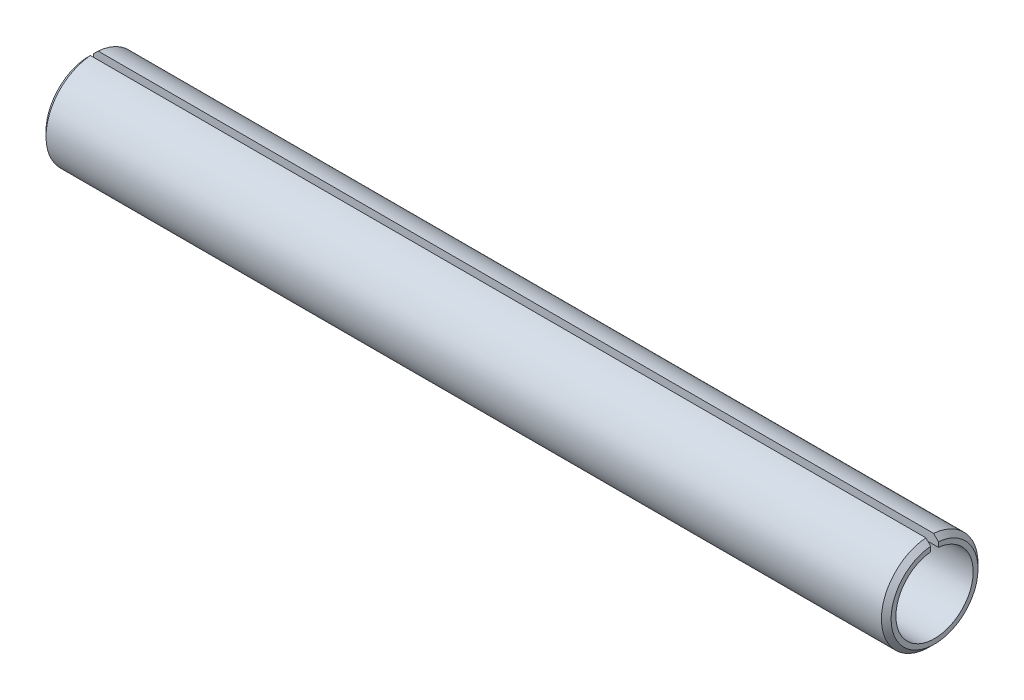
from build123d import *

# Parameters (mm, degrees)
ENL_V_MAT_EXTRU_2_DEPTH = 36.114099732


with BuildPart() as part:
    # Esquisse1 → Base-R_volution (revolve)
    with BuildSketch(Plane.XY):
        Polygon((0, 1.6), (0, 1.8), (0.2, 2), (34.8, 2), (35, 1.8), (35, 1.6), align=None)
    revolve(axis=Axis((0, 0, 0), (1, 0, 0)))

    # Esquisse2 → Enl_v. mat.-Extru.2 (cut, through all)
    with BuildSketch(Plane(origin=(0, 0, 0), x_dir=(0, 0, -1), z_dir=(1, 0, 0))):
        with BuildLine():
            Line((0.16, 1.993589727), (0.16, 1.591979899))
            ThreePointArc((0.16, 1.591979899), (0, 1.6), (-0.16, 1.591979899))
            Line((-0.16, 1.591979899), (-0.16, 1.993589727))
            ThreePointArc((-0.16, 1.993589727), (0, 2), (0.16, 1.993589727))
        make_face()
    extrude(amount=ENL_V_MAT_EXTRU_2_DEPTH, mode=Mode.SUBTRACT)


solid = part.part
